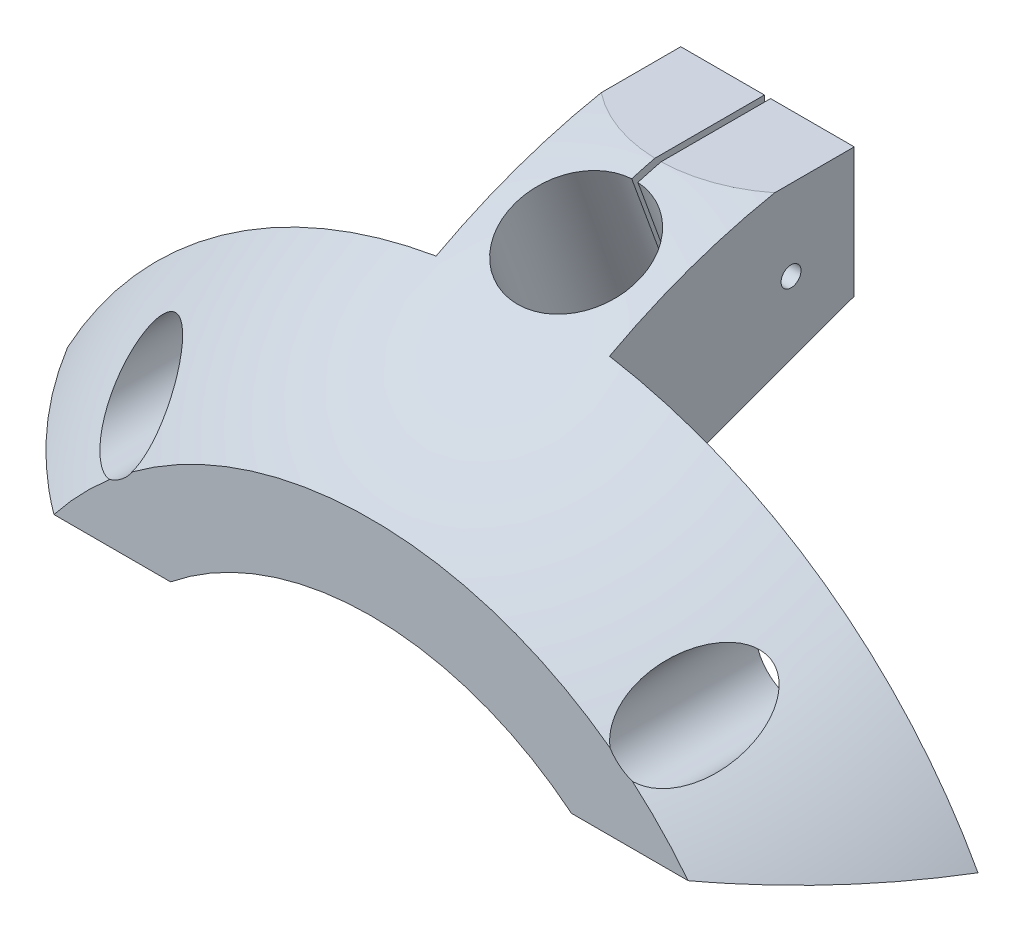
ISO-10303-21;
HEADER;
FILE_DESCRIPTION(('STEP AP214'),'2;1');
FILE_NAME('part.step','',(''),(''),'','','');
FILE_SCHEMA(('AUTOMOTIVE_DESIGN { 1 0 10303 214 1 1 1 1 }'));
ENDSEC;
DATA;
#1=APPLICATION_CONTEXT('core data for automotive mechanical design processes');
#2=APPLICATION_PROTOCOL_DEFINITION('international standard','automotive_design',2000,#1);
#3=PRODUCT_CONTEXT('',#1,'mechanical');
#4=PRODUCT('Part','Part','',(#3));
#5=PRODUCT_RELATED_PRODUCT_CATEGORY('part','',(#4));
#6=PRODUCT_DEFINITION_FORMATION('','',#4);
#7=PRODUCT_DEFINITION_CONTEXT('part definition',#1,'design');
#8=PRODUCT_DEFINITION('design','',#6,#7);
#9=PRODUCT_DEFINITION_SHAPE('','',#8);
#10=(LENGTH_UNIT() NAMED_UNIT(*) SI_UNIT(.MILLI.,.METRE.));
#11=(NAMED_UNIT(*) PLANE_ANGLE_UNIT() SI_UNIT($,.RADIAN.));
#12=(NAMED_UNIT(*) SI_UNIT($,.STERADIAN.) SOLID_ANGLE_UNIT());
#13=UNCERTAINTY_MEASURE_WITH_UNIT(LENGTH_MEASURE(1.E-05),#10,'distance_accuracy_value','');
#14=(GEOMETRIC_REPRESENTATION_CONTEXT(3) GLOBAL_UNCERTAINTY_ASSIGNED_CONTEXT((#13)) GLOBAL_UNIT_ASSIGNED_CONTEXT((#10,
#11,#12)) REPRESENTATION_CONTEXT('',''));
#15=CARTESIAN_POINT('',(0.,0.,0.));
#16=DIRECTION('',(0.,0.,1.));
#17=DIRECTION('',(1.,0.,0.));
#18=AXIS2_PLACEMENT_3D('',#15,#16,#17);
#19=CARTESIAN_POINT('',(26.19375,146.05,-152.4));
#20=DIRECTION('',(0.,1.,0.));
#21=DIRECTION('',(0.,0.,1.));
#22=AXIS2_PLACEMENT_3D('',#19,#20,#21);
#23=PLANE('',#22);
#24=CARTESIAN_POINT('',(0.,146.05,42.8997677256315));
#25=DIRECTION('',(0.,1.,0.));
#26=DIRECTION('',(0.,0.,1.));
#27=AXIS2_PLACEMENT_3D('',#24,#25,#26);
#28=CIRCLE('',#27,35.9757938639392);
#29=CARTESIAN_POINT('',(-0.793750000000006,146.05,78.866804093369));
#30=VERTEX_POINT('',#29);
#31=CARTESIAN_POINT('',(-22.225,146.05,71.1894676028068));
#32=VERTEX_POINT('',#31);
#33=EDGE_CURVE('E270',#30,#32,#28,.F.);
#34=ORIENTED_EDGE('',*,*,#33,.F.);
#35=DIRECTION('',(0.,0.,1.));
#36=VECTOR('',#35,1.);
#37=CARTESIAN_POINT('',(-0.79375,146.05,26.3876239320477));
#38=LINE('',#37,#36);
#39=CARTESIAN_POINT('',(-0.793750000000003,146.05,50.8000000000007));
#40=VERTEX_POINT('',#39);
#41=EDGE_CURVE('E374',#40,#30,#38,.T.);
#42=ORIENTED_EDGE('',*,*,#41,.F.);
#43=DIRECTION('',(1.,0.,0.));
#44=VECTOR('',#43,1.);
#45=CARTESIAN_POINT('',(-26.19375,146.05,50.8000000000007));
#46=LINE('',#45,#44);
#47=CARTESIAN_POINT('',(-22.225,146.05,50.8000000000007));
#48=VERTEX_POINT('',#47);
#49=EDGE_CURVE('E249',#48,#40,#46,.T.);
#50=ORIENTED_EDGE('',*,*,#49,.F.);
#51=DIRECTION('',(0.,0.,-1.));
#52=VECTOR('',#51,1.);
#53=CARTESIAN_POINT('',(-22.225,146.05,113.50625));
#54=LINE('',#53,#52);
#55=EDGE_CURVE('E220',#32,#48,#54,.T.);
#56=ORIENTED_EDGE('',*,*,#55,.F.);
#57=EDGE_LOOP('',(#34,#42,#50,#56));
#58=FACE_BOUND('',#57,.T.);
#59=ADVANCED_FACE('F43',(#58),#23,.T.);
#60=CARTESIAN_POINT('',(0.793750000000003,146.05,50.8000000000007));
#61=VERTEX_POINT('',#60);
#62=CARTESIAN_POINT('',(22.225,146.05,50.8000000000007));
#63=VERTEX_POINT('',#62);
#64=EDGE_CURVE('E248',#61,#63,#46,.T.);
#65=ORIENTED_EDGE('',*,*,#64,.F.);
#66=DIRECTION('',(0.,0.,-1.));
#67=VECTOR('',#66,1.);
#68=CARTESIAN_POINT('',(0.79375,146.05,26.3876239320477));
#69=LINE('',#68,#67);
#70=CARTESIAN_POINT('',(0.793750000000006,146.05,78.866804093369));
#71=VERTEX_POINT('',#70);
#72=EDGE_CURVE('E391',#71,#61,#69,.T.);
#73=ORIENTED_EDGE('',*,*,#72,.F.);
#74=CARTESIAN_POINT('',(22.225,146.05,71.1894676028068));
#75=VERTEX_POINT('',#74);
#76=EDGE_CURVE('E272',#75,#71,#28,.F.);
#77=ORIENTED_EDGE('',*,*,#76,.F.);
#78=DIRECTION('',(0.,0.,1.));
#79=VECTOR('',#78,1.);
#80=CARTESIAN_POINT('',(22.225,146.05,113.50625));
#81=LINE('',#80,#79);
#82=EDGE_CURVE('E233',#63,#75,#81,.T.);
#83=ORIENTED_EDGE('',*,*,#82,.F.);
#84=EDGE_LOOP('',(#65,#73,#77,#83));
#85=FACE_BOUND('',#84,.T.);
#86=ADVANCED_FACE('F343',(#85),#23,.T.);
#87=CARTESIAN_POINT('',(0.,0.,-152.4));
#88=DIRECTION('',(0.,0.,1.));
#89=DIRECTION('',(1.,0.,0.));
#90=AXIS2_PLACEMENT_3D('',#87,#88,#89);
#91=CYLINDRICAL_SURFACE('',#90,81.676875);
#92=DIRECTION('',(0.,0.,1.));
#93=VECTOR('',#92,1.);
#94=CARTESIAN_POINT('',(-51.3698540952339,63.5,-152.4));
#95=LINE('',#94,#93);
#96=CARTESIAN_POINT('',(-51.3698540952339,63.5,113.50625));
#97=VERTEX_POINT('',#96);
#98=CARTESIAN_POINT('',(-51.3698540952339,63.5,152.4));
#99=VERTEX_POINT('',#98);
#100=EDGE_CURVE('E257',#97,#99,#95,.T.);
#101=ORIENTED_EDGE('',*,*,#100,.F.);
#102=CARTESIAN_POINT('',(0.,0.,113.50625));
#103=DIRECTION('',(0.,0.,-1.));
#104=DIRECTION('',(-1.,0.,0.));
#105=AXIS2_PLACEMENT_3D('',#102,#103,#104);
#106=CIRCLE('',#105,81.676875);
#107=CARTESIAN_POINT('',(51.369854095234,63.5,113.50625));
#108=VERTEX_POINT('',#107);
#109=EDGE_CURVE('E245',#97,#108,#106,.T.);
#110=ORIENTED_EDGE('',*,*,#109,.T.);
#111=DIRECTION('',(0.,0.,1.));
#112=VECTOR('',#111,1.);
#113=CARTESIAN_POINT('',(51.369854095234,63.5,-152.4));
#114=LINE('',#113,#112);
#115=CARTESIAN_POINT('',(51.369854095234,63.5,152.4));
#116=VERTEX_POINT('',#115);
#117=EDGE_CURVE('E261',#116,#108,#114,.F.);
#118=ORIENTED_EDGE('',*,*,#117,.F.);
#119=CARTESIAN_POINT('',(0.,0.,152.4));
#120=DIRECTION('',(0.,0.,-1.));
#121=DIRECTION('',(1.,0.,0.));
#122=AXIS2_PLACEMENT_3D('',#119,#120,#121);
#123=CIRCLE('',#122,81.676875);
#124=EDGE_CURVE('E276',#99,#116,#123,.T.);
#125=ORIENTED_EDGE('',*,*,#124,.F.);
#126=EDGE_LOOP('',(#101,#110,#118,#125));
#127=FACE_BOUND('',#126,.T.);
#128=ADVANCED_FACE('F348',(#127),#91,.F.);
#129=CARTESIAN_POINT('',(0.,0.,42.8997677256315));
#130=DIRECTION('',(0.,0.,-1.));
#131=DIRECTION('',(0.,1.,0.));
#132=AXIS2_PLACEMENT_3D('',#129,#130,#131);
#133=SPHERICAL_SURFACE('',#132,150.415625);
#134=CARTESIAN_POINT('',(-0.793750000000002,0.,42.8997677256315));
#135=DIRECTION('',(1.,0.,0.));
#136=DIRECTION('',(0.,0.,-1.));
#137=AXIS2_PLACEMENT_3D('',#134,#135,#136);
#138=CIRCLE('',#137,150.413530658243);
#139=CARTESIAN_POINT('',(-0.793750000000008,144.457816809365,84.8064422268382));
#140=VERTEX_POINT('',#139);
#141=EDGE_CURVE('E72',#30,#140,#138,.T.);
#142=ORIENTED_EDGE('',*,*,#141,.F.);
#143=ORIENTED_EDGE('',*,*,#33,.T.);
#144=CARTESIAN_POINT('',(-22.225,0.,42.8997677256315));
#145=DIRECTION('',(-1.,0.,0.));
#146=DIRECTION('',(0.,0.,1.));
#147=AXIS2_PLACEMENT_3D('',#144,#145,#146);
#148=CIRCLE('',#147,148.76461144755);
#149=CARTESIAN_POINT('',(-22.225,130.941339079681,113.50625));
#150=VERTEX_POINT('',#149);
#151=EDGE_CURVE('E224',#150,#32,#148,.T.);
#152=ORIENTED_EDGE('',*,*,#151,.F.);
#153=CARTESIAN_POINT('',(0.,0.,113.50625));
#154=DIRECTION('',(0.,0.,-1.));
#155=DIRECTION('',(-1.,0.,0.));
#156=AXIS2_PLACEMENT_3D('',#153,#154,#155);
#157=CIRCLE('',#156,132.814099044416);
#158=CARTESIAN_POINT('',(-116.650481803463,63.5,113.50625));
#159=VERTEX_POINT('',#158);
#160=EDGE_CURVE('E218',#159,#150,#157,.T.);
#161=ORIENTED_EDGE('',*,*,#160,.F.);
#162=CARTESIAN_POINT('',(0.,63.5,42.8997677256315));
#163=DIRECTION('',(0.,1.,0.));
#164=DIRECTION('',(0.,0.,1.));
#165=AXIS2_PLACEMENT_3D('',#162,#163,#164);
#166=CIRCLE('',#165,136.354722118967);
#167=CARTESIAN_POINT('',(-81.2545960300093,63.5,152.4));
#168=VERTEX_POINT('',#167);
#169=EDGE_CURVE('E280',#159,#168,#166,.T.);
#170=ORIENTED_EDGE('',*,*,#169,.T.);
#171=CARTESIAN_POINT('',(0.,0.,152.4));
#172=DIRECTION('',(0.,0.,-1.));
#173=DIRECTION('',(-1.,0.,0.));
#174=AXIS2_PLACEMENT_3D('',#171,#172,#173);
#175=CIRCLE('',#174,103.124);
#176=CARTESIAN_POINT('',(-66.9837098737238,78.4075378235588,152.4));
#177=VERTEX_POINT('',#176);
#178=EDGE_CURVE('E266',#168,#177,#175,.T.);
#179=ORIENTED_EDGE('',*,*,#178,.T.);
#180=CARTESIAN_POINT('',(-66.9831572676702,78.4077306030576,152.4002));
#181=CARTESIAN_POINT('',(-67.5616816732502,78.2059306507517,152.19081770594));
#182=CARTESIAN_POINT('',(-68.1387715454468,78.058144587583,151.937880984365));
#183=CARTESIAN_POINT('',(-68.9879499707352,77.9078508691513,151.509117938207));
#184=CARTESIAN_POINT('',(-69.2667274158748,77.8696691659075,151.358961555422));
#185=CARTESIAN_POINT('',(-69.8183394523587,77.8147274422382,151.044253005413));
#186=CARTESIAN_POINT('',(-70.0911700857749,77.7979812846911,150.879691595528));
#187=CARTESIAN_POINT('',(-70.703972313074,77.7823483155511,150.491033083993));
#188=CARTESIAN_POINT('',(-71.0416459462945,77.789681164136,150.263056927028));
#189=CARTESIAN_POINT('',(-71.7032600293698,77.8331550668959,149.790686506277));
#190=CARTESIAN_POINT('',(-72.0271987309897,77.869299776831,149.546290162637));
#191=CARTESIAN_POINT('',(-72.6620158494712,77.967572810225,149.04267478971));
#192=CARTESIAN_POINT('',(-72.9728150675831,78.0298391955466,148.78338341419));
#193=CARTESIAN_POINT('',(-73.5789022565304,78.1776009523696,148.253626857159));
#194=CARTESIAN_POINT('',(-73.8741890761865,78.2630980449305,147.983160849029));
#195=CARTESIAN_POINT('',(-74.5704481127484,78.4954562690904,147.316771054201));
#196=CARTESIAN_POINT('',(-74.9633651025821,78.652982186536,146.916118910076));
#197=CARTESIAN_POINT('',(-75.7170138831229,79.0044149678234,146.1007167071));
#198=CARTESIAN_POINT('',(-76.0777326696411,79.1983364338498,145.685961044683));
#199=CARTESIAN_POINT('',(-76.7667715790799,79.6178210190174,144.846147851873));
#200=CARTESIAN_POINT('',(-77.095106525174,79.8433695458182,144.421095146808));
#201=CARTESIAN_POINT('',(-77.719621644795,80.3224385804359,143.563392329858));
#202=CARTESIAN_POINT('',(-78.0158055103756,80.5759558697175,143.13074309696));
#203=CARTESIAN_POINT('',(-78.5853466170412,81.116814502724,142.245766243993));
#204=CARTESIAN_POINT('',(-78.8576270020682,81.4049963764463,141.793260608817));
#205=CARTESIAN_POINT('',(-79.3677705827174,82.0054848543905,140.884864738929));
#206=CARTESIAN_POINT('',(-79.6056316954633,82.3177929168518,140.428974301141));
#207=CARTESIAN_POINT('',(-80.0465719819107,82.9646880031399,139.515652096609));
#208=CARTESIAN_POINT('',(-80.2496273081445,83.299290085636,139.058219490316));
#209=CARTESIAN_POINT('',(-80.619844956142,83.9889551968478,138.144285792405));
#210=CARTESIAN_POINT('',(-80.7870090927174,84.3440171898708,137.687784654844));
#211=CARTESIAN_POINT('',(-81.0852316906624,85.0763001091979,136.774345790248));
#212=CARTESIAN_POINT('',(-81.2159902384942,85.4536757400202,136.317433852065));
#213=CARTESIAN_POINT('',(-81.4375018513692,86.2270917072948,135.409497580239));
#214=CARTESIAN_POINT('',(-81.5282467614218,86.623135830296,134.958474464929));
#215=CARTESIAN_POINT('',(-81.666550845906,87.4324100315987,134.066512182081));
#216=CARTESIAN_POINT('',(-81.7141766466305,87.8456125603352,133.625558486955));
#217=CARTESIAN_POINT('',(-81.7622678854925,88.6889366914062,132.757602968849));
#218=CARTESIAN_POINT('',(-81.7627617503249,89.1190479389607,132.330592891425));
#219=CARTESIAN_POINT('',(-81.7218224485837,89.8099568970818,131.673062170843));
#220=CARTESIAN_POINT('',(-81.6980272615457,90.0654560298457,131.435796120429));
#221=CARTESIAN_POINT('',(-81.6313774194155,90.5814832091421,130.969599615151));
#222=CARTESIAN_POINT('',(-81.5885279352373,90.8420098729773,130.740666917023));
#223=CARTESIAN_POINT('',(-81.4821470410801,91.3675153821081,130.293239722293));
#224=CARTESIAN_POINT('',(-81.4186291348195,91.6324912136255,130.07473851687));
#225=CARTESIAN_POINT('',(-81.2689822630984,92.166330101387,129.650572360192));
#226=CARTESIAN_POINT('',(-81.1828589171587,92.4351921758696,129.444904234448));
#227=CARTESIAN_POINT('',(-81.0097919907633,92.9100168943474,129.097635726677));
#228=CARTESIAN_POINT('',(-80.92812721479,93.1153976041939,128.952606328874));
#229=CARTESIAN_POINT('',(-80.7496163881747,93.5270336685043,128.673443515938));
#230=CARTESIAN_POINT('',(-80.6527704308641,93.7332890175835,128.539310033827));
#231=CARTESIAN_POINT('',(-80.4430764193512,94.1454023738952,128.284102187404));
#232=CARTESIAN_POINT('',(-80.330247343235,94.351260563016,128.163012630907));
#233=CARTESIAN_POINT('',(-80.0877155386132,94.7613878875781,127.936036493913));
#234=CARTESIAN_POINT('',(-79.958019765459,94.9656576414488,127.83014368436));
#235=CARTESIAN_POINT('',(-79.7132978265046,95.3239017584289,127.658515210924));
#236=CARTESIAN_POINT('',(-79.6018248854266,95.4785736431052,127.589157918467));
#237=CARTESIAN_POINT('',(-79.3686346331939,95.7848422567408,127.462082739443));
#238=CARTESIAN_POINT('',(-79.2469231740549,95.9364406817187,127.404358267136));
#239=CARTESIAN_POINT('',(-78.9934724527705,96.2354052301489,127.301659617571));
#240=CARTESIAN_POINT('',(-78.8617384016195,96.3827734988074,127.256678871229));
#241=CARTESIAN_POINT('',(-78.5886710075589,96.6720940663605,127.180419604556));
#242=CARTESIAN_POINT('',(-78.4473376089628,96.814046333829,127.14914116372));
#243=CARTESIAN_POINT('',(-78.1550475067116,97.0920059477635,127.100911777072));
#244=CARTESIAN_POINT('',(-78.004041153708,97.2279753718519,127.084042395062));
#245=CARTESIAN_POINT('',(-77.6942355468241,97.4918396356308,127.06537055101));
#246=CARTESIAN_POINT('',(-77.5354363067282,97.6197344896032,127.063568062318));
#247=CARTESIAN_POINT('',(-77.2113743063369,97.8663499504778,127.075078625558));
#248=CARTESIAN_POINT('',(-77.0461109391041,97.9850696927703,127.088393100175));
#249=CARTESIAN_POINT('',(-76.7106138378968,98.21245890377,127.129788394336));
#250=CARTESIAN_POINT('',(-76.5403802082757,98.3211285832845,127.157868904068));
#251=CARTESIAN_POINT('',(-76.2099940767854,98.5197061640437,127.225325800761));
#252=CARTESIAN_POINT('',(-76.0501047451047,98.6104177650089,127.263637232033));
#253=CARTESIAN_POINT('',(-75.7284472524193,98.7826537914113,127.351440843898));
#254=CARTESIAN_POINT('',(-75.5666785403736,98.8641754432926,127.400936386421));
#255=CARTESIAN_POINT('',(-75.0800572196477,99.0948741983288,127.564941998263));
#256=CARTESIAN_POINT('',(-74.7537331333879,99.2302780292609,127.695004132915));
#257=CARTESIAN_POINT('',(-74.1844206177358,99.4365669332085,127.952582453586));
#258=CARTESIAN_POINT('',(-73.9407446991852,99.515127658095,128.072802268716));
#259=CARTESIAN_POINT('',(-73.4566013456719,99.6535505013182,128.329491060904));
#260=CARTESIAN_POINT('',(-73.2161345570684,99.7134089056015,128.465963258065));
#261=CARTESIAN_POINT('',(-72.7391901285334,99.8158809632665,128.75278540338));
#262=CARTESIAN_POINT('',(-72.5027225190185,99.8584560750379,128.9031654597));
#263=CARTESIAN_POINT('',(-72.0350681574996,99.9275903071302,129.21527120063));
#264=CARTESIAN_POINT('',(-71.8038813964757,99.9541494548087,129.376996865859));
#265=CARTESIAN_POINT('',(-71.2226142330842,100.003065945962,129.800733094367));
#266=CARTESIAN_POINT('',(-70.8764573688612,100.015231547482,130.069332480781));
#267=CARTESIAN_POINT('',(-70.1984302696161,100.008751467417,130.623665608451));
#268=CARTESIAN_POINT('',(-69.8665678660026,99.9900891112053,130.90940854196));
#269=CARTESIAN_POINT('',(-69.2168883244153,99.9253538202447,131.494342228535));
#270=CARTESIAN_POINT('',(-68.8990930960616,99.8792396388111,131.793552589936));
#271=CARTESIAN_POINT('',(-68.2780461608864,99.7623619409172,132.401903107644));
#272=CARTESIAN_POINT('',(-67.9747936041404,99.6915998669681,132.711042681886));
#273=CARTESIAN_POINT('',(-67.2318879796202,99.4859309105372,133.496239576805));
#274=CARTESIAN_POINT('',(-66.8013329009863,99.3367055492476,133.97720111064));
#275=CARTESIAN_POINT('',(-65.9723399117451,98.9929162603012,134.950578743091));
#276=CARTESIAN_POINT('',(-65.5739177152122,98.7983303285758,135.443000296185));
#277=CARTESIAN_POINT('',(-64.8090150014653,98.3676459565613,136.435307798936));
#278=CARTESIAN_POINT('',(-64.4425684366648,98.1315041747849,136.935201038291));
#279=CARTESIAN_POINT('',(-63.7428221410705,97.6208035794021,137.93834274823));
#280=CARTESIAN_POINT('',(-63.4095169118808,97.3462511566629,138.441590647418));
#281=CARTESIAN_POINT('',(-62.7686538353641,96.7527958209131,139.462266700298));
#282=CARTESIAN_POINT('',(-62.4620460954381,96.4328875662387,139.97970727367));
#283=CARTESIAN_POINT('',(-61.887266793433,95.756290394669,141.01206479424));
#284=CARTESIAN_POINT('',(-61.6191013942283,95.3995955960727,141.526981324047));
#285=CARTESIAN_POINT('',(-61.1247252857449,94.6512331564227,142.550330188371));
#286=CARTESIAN_POINT('',(-60.8984578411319,94.2596138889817,143.058770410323));
#287=CARTESIAN_POINT('',(-60.4916511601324,93.442126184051,144.066220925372));
#288=CARTESIAN_POINT('',(-60.3110944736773,93.0162708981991,144.565234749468));
#289=CARTESIAN_POINT('',(-60.046713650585,92.261539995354,145.404846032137));
#290=CARTESIAN_POINT('',(-59.9500561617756,91.9409521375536,145.74889345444));
#291=CARTESIAN_POINT('',(-59.7846360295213,91.2837230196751,146.428360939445));
#292=CARTESIAN_POINT('',(-59.7158729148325,90.9470820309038,146.763781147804));
#293=CARTESIAN_POINT('',(-59.6091130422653,90.2585899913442,147.42359735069));
#294=CARTESIAN_POINT('',(-59.5711066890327,89.9067437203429,147.747996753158));
#295=CARTESIAN_POINT('',(-59.5291896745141,89.1888718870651,148.382993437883));
#296=CARTESIAN_POINT('',(-59.5252680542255,88.8228509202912,148.693595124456));
#297=CARTESIAN_POINT('',(-59.5512573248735,88.1809949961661,149.214115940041));
#298=CARTESIAN_POINT('',(-59.5721300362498,87.9081476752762,149.428164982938));
#299=CARTESIAN_POINT('',(-59.6354155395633,87.3568498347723,149.845450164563));
#300=CARTESIAN_POINT('',(-59.6778280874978,87.078399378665,150.048686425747));
#301=CARTESIAN_POINT('',(-59.8397245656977,86.2382997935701,150.637876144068));
#302=CARTESIAN_POINT('',(-59.9939376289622,85.6693093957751,151.005432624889));
#303=CARTESIAN_POINT('',(-60.3317530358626,84.7412232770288,151.546231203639));
#304=CARTESIAN_POINT('',(-60.4830999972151,84.3827591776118,151.740904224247));
#305=CARTESIAN_POINT('',(-60.8313777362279,83.6689582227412,152.097294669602));
#306=CARTESIAN_POINT('',(-61.0285472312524,83.3136482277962,152.25883086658));
#307=CARTESIAN_POINT('',(-61.2496155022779,82.9638486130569,152.4002));
#308=B_SPLINE_CURVE_WITH_KNOTS('',3,(#180,#181,#182,#183,#184,#185,#186,#187,#188,#189,#190,
#191,#192,#193,#194,#195,#196,#197,#198,#199,#200,#201,#202,#203,#204,#205,#206,#207,#208,#209,
#210,#211,#212,#213,#214,#215,#216,#217,#218,#219,#220,#221,#222,#223,#224,#225,#226,#227,#228,
#229,#230,#231,#232,#233,#234,#235,#236,#237,#238,#239,#240,#241,#242,#243,#244,#245,#246,#247,
#248,#249,#250,#251,#252,#253,#254,#255,#256,#257,#258,#259,#260,#261,#262,#263,#264,#265,#266,
#267,#268,#269,#270,#271,#272,#273,#274,#275,#276,#277,#278,#279,#280,#281,#282,#283,#284,#285,
#286,#287,#288,#289,#290,#291,#292,#293,#294,#295,#296,#297,#298,#299,#300,#301,#302,#303,#304,
#305,#306,#307),.UNSPECIFIED.,.F.,.F.,(4,2,2,2,2,2,2,2,2,2,2,2,2,2,2,2,2,2,2,2,2,2,2,2,2,2,2,2,
2,2,2,2,2,2,2,2,2,2,2,2,2,2,2,2,2,2,2,2,2,2,2,2,2,2,2,2,2,2,2,2,2,2,2,4),(0.,1.93278309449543,
2.88836836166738,3.84457131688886,5.0652091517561,6.28600189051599,7.51332988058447,
8.74074882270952,10.48672465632,12.2334024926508,13.9792770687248,15.7249509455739,
17.5282746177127,19.3317073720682,21.1363708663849,22.9409430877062,24.759969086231,
26.5793656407,28.3959460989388,30.2114309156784,31.2593500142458,32.3069849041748,
33.3539366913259,34.4006284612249,35.1931215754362,35.9856098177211,36.7771648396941,
37.568394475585,38.1764797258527,38.7842197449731,39.3916459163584,39.9990756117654,
40.6099213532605,41.2207660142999,41.8316681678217,42.4425575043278,43.0052902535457,
43.5681923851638,44.6934478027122,45.54094282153,46.3886060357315,47.2381492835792,
48.0876910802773,49.4005669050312,50.7141530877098,52.029717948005,53.3452058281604,
55.3299629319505,57.3156848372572,59.3034901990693,61.2909652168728,63.3326437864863,
65.3746493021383,67.4138691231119,69.4523092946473,70.8915735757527,72.3308135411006,
73.769604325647,75.2079324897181,76.2493211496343,77.2906980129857,79.3634887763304,
80.6654610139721,81.9743743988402),.UNSPECIFIED.);
#309=CARTESIAN_POINT('',(-61.2493028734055,82.9643433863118,152.4));
#310=VERTEX_POINT('',#309);
#311=EDGE_CURVE('E303',#177,#310,#308,.T.);
#312=ORIENTED_EDGE('',*,*,#311,.T.);
#313=CARTESIAN_POINT('',(61.2493028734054,82.9643433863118,152.4));
#314=VERTEX_POINT('',#313);
#315=EDGE_CURVE('E271',#310,#314,#175,.T.);
#316=ORIENTED_EDGE('',*,*,#315,.T.);
#317=CARTESIAN_POINT('',(61.2496155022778,82.9638486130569,152.4002));
#318=CARTESIAN_POINT('',(60.9223444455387,83.4818325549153,152.19081770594));
#319=CARTESIAN_POINT('',(60.6480151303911,84.0106206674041,151.937880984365));
#320=CARTESIAN_POINT('',(60.3097787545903,84.8038976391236,151.509117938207));
#321=CARTESIAN_POINT('',(60.2096087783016,85.0668437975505,151.358961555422));
#322=CARTESIAN_POINT('',(60.0314792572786,85.5917859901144,151.044253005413));
#323=CARTESIAN_POINT('',(59.9535341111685,85.8537813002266,150.879691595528));
#324=CARTESIAN_POINT('',(59.7998745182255,86.4472117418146,150.491033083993));
#325=CARTESIAN_POINT('',(59.7307380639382,86.7778133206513,150.263056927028));
#326=CARTESIAN_POINT('',(59.6236309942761,87.4321459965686,149.790686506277));
#327=CARTESIAN_POINT('',(59.5856643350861,87.755876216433,149.546290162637));
#328=CARTESIAN_POINT('',(59.5379932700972,88.3964836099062,149.04267478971));
#329=CARTESIAN_POINT('',(59.5284412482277,88.7133148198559,148.78338341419));
#330=CARTESIAN_POINT('',(59.53546970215,89.3371143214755,148.253626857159));
#331=CARTESIAN_POINT('',(59.5520521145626,89.6440818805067,147.983160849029));
#332=CARTESIAN_POINT('',(59.6211206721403,90.3748325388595,147.316771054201));
#333=CARTESIAN_POINT('',(59.685815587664,90.7931777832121,146.916118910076));
#334=CARTESIAN_POINT('',(59.8579165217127,91.6067334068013,146.100716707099));
#335=CARTESIAN_POINT('',(59.9653397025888,92.0019344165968,145.685961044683));
#336=CARTESIAN_POINT('',(60.2183286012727,92.7679230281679,144.846147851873));
#337=CARTESIAN_POINT('',(60.3638767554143,93.1387217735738,144.421095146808));
#338=CARTESIAN_POINT('',(60.6894856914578,93.8553144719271,143.563392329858));
#339=CARTESIAN_POINT('',(60.8695425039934,94.2011112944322,143.13074309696));
#340=CARTESIAN_POINT('',(61.2677623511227,94.8781091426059,142.245766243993));
#341=CARTESIAN_POINT('',(61.4869874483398,95.20845102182,141.793260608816));
#342=CARTESIAN_POINT('',(61.9567135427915,95.8410569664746,140.884864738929));
#343=CARTESIAN_POINT('',(62.2072164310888,96.1433193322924,140.428974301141));
#344=CARTESIAN_POINT('',(62.7377824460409,96.7189939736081,139.515652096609));
#345=CARTESIAN_POINT('',(63.0178656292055,96.9923864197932,139.058219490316));
#346=CARTESIAN_POINT('',(63.6060721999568,97.5088281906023,138.144285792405));
#347=CARTESIAN_POINT('',(63.9141941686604,97.7518790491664,137.687784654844));
#348=CARTESIAN_POINT('',(64.560180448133,98.2078140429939,136.774345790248));
#349=CARTESIAN_POINT('',(64.8982632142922,98.4204409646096,136.317433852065));
#350=CARTESIAN_POINT('',(65.6016481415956,98.8109397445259,135.409497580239));
#351=CARTESIAN_POINT('',(65.9669558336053,98.9888045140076,134.958474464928));
#352=CARTESIAN_POINT('',(66.724068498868,99.306346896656,134.066512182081));
#353=CARTESIAN_POINT('',(67.1158315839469,99.4460831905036,133.625558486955));
#354=CARTESIAN_POINT('',(67.926492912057,99.6834364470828,132.757602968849));
#355=CARTESIAN_POINT('',(68.3453746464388,99.7810787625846,132.330592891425));
#356=CARTESIAN_POINT('',(69.0276723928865,99.8972725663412,131.673062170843));
#357=CARTESIAN_POINT('',(69.2819424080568,99.9318091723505,131.435796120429));
#358=CARTESIAN_POINT('',(69.7996868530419,99.9834516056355,130.969599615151));
#359=CARTESIAN_POINT('',(70.0631587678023,100.000562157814,130.740666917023));
#360=CARTESIAN_POINT('',(70.5991116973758,100.015641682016,130.293239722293));
#361=CARTESIAN_POINT('',(70.8715867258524,100.013623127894,130.07473851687));
#362=CARTESIAN_POINT('',(71.4254313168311,99.9884375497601,129.650572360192));
#363=CARTESIAN_POINT('',(71.7067986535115,99.9652757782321,129.444904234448));
#364=CARTESIAN_POINT('',(72.2084450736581,99.9039443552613,129.097635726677));
#365=CARTESIAN_POINT('',(72.4269647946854,99.8707855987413,128.952606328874));
#366=CARTESIAN_POINT('',(72.8682856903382,99.7898768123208,128.673443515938));
#367=CARTESIAN_POINT('',(73.0910868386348,99.7421268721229,128.539310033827));
#368=CARTESIAN_POINT('',(73.5399169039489,99.6309487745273,128.284102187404));
#369=CARTESIAN_POINT('',(73.7659417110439,99.5675391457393,128.163012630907));
#370=CARTESIAN_POINT('',(74.2202550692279,99.4239234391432,127.936036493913));
#371=CARTESIAN_POINT('',(74.4485426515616,99.3437242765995,127.83014368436));
#372=CARTESIAN_POINT('',(74.852808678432,99.1862547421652,127.658515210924));
#373=CARTESIAN_POINT('',(75.0286639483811,99.1126033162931,127.589157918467));
#374=CARTESIAN_POINT('',(75.37969300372,98.954626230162,127.462082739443));
#375=CARTESIAN_POINT('',(75.5548671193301,98.8703066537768,127.404358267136));
#376=CARTESIAN_POINT('',(75.9033577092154,98.6909428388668,127.301659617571));
#377=CARTESIAN_POINT('',(76.0766750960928,98.5959041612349,127.256678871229));
#378=CARTESIAN_POINT('',(76.4202023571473,98.3952521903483,127.180419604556));
#379=CARTESIAN_POINT('',(76.5904122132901,98.2896388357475,127.14914116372));
#380=CARTESIAN_POINT('',(76.9272145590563,98.0676946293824,127.100911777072));
#381=CARTESIAN_POINT('',(77.0937813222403,97.9513068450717,127.084042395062));
#382=CARTESIAN_POINT('',(77.4208093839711,97.7091157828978,127.06537055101));
#383=CARTESIAN_POINT('',(77.5812706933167,97.5833125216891,127.063568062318));
#384=CARTESIAN_POINT('',(77.8947163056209,97.3233371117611,127.075078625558));
#385=CARTESIAN_POINT('',(78.0476999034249,97.1891641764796,127.088393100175));
#386=CARTESIAN_POINT('',(78.3449994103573,96.9137060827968,127.129788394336));
#387=CARTESIAN_POINT('',(78.4893155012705,96.7724210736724,127.157868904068));
#388=CARTESIAN_POINT('',(78.7573935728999,96.4954333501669,127.225325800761));
#389=CARTESIAN_POINT('',(78.8818790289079,96.3601685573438,127.263637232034));
#390=CARTESIAN_POINT('',(79.1223246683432,96.0857333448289,127.351440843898));
#391=CARTESIAN_POINT('',(79.2382822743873,95.9465617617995,127.400936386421));
#392=CARTESIAN_POINT('',(79.5729444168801,95.5246334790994,127.564941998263));
#393=CARTESIAN_POINT('',(79.778564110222,95.2373319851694,127.695004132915));
#394=CARTESIAN_POINT('',(80.1081271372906,94.7293358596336,127.952582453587));
#395=CARTESIAN_POINT('',(80.2397030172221,94.5097054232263,128.072802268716));
#396=CARTESIAN_POINT('',(80.4839147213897,94.0693461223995,128.329491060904));
#397=CARTESIAN_POINT('',(80.5965467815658,93.8486170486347,128.465963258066));
#398=CARTESIAN_POINT('',(80.8041107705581,93.4071493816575,128.75278540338));
#399=CARTESIAN_POINT('',(80.8990028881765,93.1864118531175,128.903165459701));
#400=CARTESIAN_POINT('',(81.0719921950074,92.7464631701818,129.215271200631));
#401=CARTESIAN_POINT('',(81.1500894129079,92.5272520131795,129.376996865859));
#402=CARTESIAN_POINT('',(81.3290484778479,91.9720601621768,129.800733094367));
#403=CARTESIAN_POINT('',(81.4190957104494,91.6375992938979,130.069332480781));
#404=CARTESIAN_POINT('',(81.5659480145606,90.9756346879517,130.623665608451));
#405=CARTESIAN_POINT('',(81.6227350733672,90.6481348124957,130.90940854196));
#406=CARTESIAN_POINT('',(81.7064343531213,90.0006252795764,131.494342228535));
#407=CARTESIAN_POINT('',(81.7333014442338,89.6806276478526,131.793552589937));
#408=CARTESIAN_POINT('',(81.7597381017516,89.049231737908,132.401903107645));
#409=CARTESIAN_POINT('',(81.7593092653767,88.7378329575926,132.711042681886));
#410=CARTESIAN_POINT('',(81.7267774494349,87.9676705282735,133.496239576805));
#411=CARTESIAN_POINT('',(81.678670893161,87.5145351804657,133.97720111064));
#412=CARTESIAN_POINT('',(81.5310359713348,86.6293095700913,134.950578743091));
#413=CARTESIAN_POINT('',(81.4314826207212,86.1972296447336,135.443000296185));
#414=CARTESIAN_POINT('',(81.1847209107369,85.3548082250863,136.435307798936));
#415=CARTESIAN_POINT('',(81.0374626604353,84.9444900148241,136.935201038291));
#416=CARTESIAN_POINT('',(80.6980343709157,84.1474652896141,137.93834274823));
#417=CARTESIAN_POINT('',(80.5058717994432,83.7607548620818,138.441590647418));
#418=CARTESIAN_POINT('',(80.0725263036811,83.0023971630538,139.462266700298));
#419=CARTESIAN_POINT('',(79.8301493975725,82.631448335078,139.97970727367));
#420=CARTESIAN_POINT('',(79.3008830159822,81.9186846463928,141.012064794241));
#421=CARTESIAN_POINT('',(79.0139864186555,81.57687446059,141.526981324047));
#422=CARTESIAN_POINT('',(78.3966469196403,80.9262240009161,142.550330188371));
#423=CARTESIAN_POINT('',(78.0662639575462,80.6173393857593,143.058770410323));
#424=CARTESIAN_POINT('',(77.361804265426,80.0363795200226,144.066220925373));
#425=CARTESIAN_POINT('',(76.9877442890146,79.7642902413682,144.565234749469));
#426=CARTESIAN_POINT('',(76.31224549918,79.336251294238,145.404846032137));
#427=CARTESIAN_POINT('',(76.0217792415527,79.1696721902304,145.748893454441));
#428=CARTESIAN_POINT('',(75.4189069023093,78.8600613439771,146.428360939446));
#429=CARTESIAN_POINT('',(75.1065011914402,78.7170292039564,146.763781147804));
#430=CARTESIAN_POINT('',(74.4599228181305,78.4575000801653,147.423597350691));
#431=CARTESIAN_POINT('',(74.1257569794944,78.340994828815,147.747996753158));
#432=CARTESIAN_POINT('',(73.4359103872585,78.1379956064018,148.382993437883));
#433=CARTESIAN_POINT('',(73.0802365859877,78.05149199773,148.693595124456));
#434=CARTESIAN_POINT('',(72.4491010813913,77.9318155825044,149.214115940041));
#435=CARTESIAN_POINT('',(72.1785914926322,77.8905131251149,149.428164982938));
#436=CARTESIAN_POINT('',(71.6272480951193,77.8276257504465,149.845450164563));
#437=CARTESIAN_POINT('',(71.34641440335,77.806040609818,150.048686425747));
#438=CARTESIAN_POINT('',(70.4914584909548,77.7739755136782,150.637876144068));
#439=CARTESIAN_POINT('',(69.9023395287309,77.7956686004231,151.005432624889));
#440=CARTESIAN_POINT('',(68.9219317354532,77.9150991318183,151.54623120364));
#441=CARTESIAN_POINT('',(68.5385446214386,77.9815576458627,151.740904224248));
#442=CARTESIAN_POINT('',(67.7645195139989,78.1595866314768,152.097294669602));
#443=CARTESIAN_POINT('',(67.3738537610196,78.2713957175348,152.25883086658));
#444=CARTESIAN_POINT('',(66.9831572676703,78.4077306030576,152.4002));
#445=B_SPLINE_CURVE_WITH_KNOTS('',3,(#317,#318,#319,#320,#321,#322,#323,#324,#325,#326,#327,
#328,#329,#330,#331,#332,#333,#334,#335,#336,#337,#338,#339,#340,#341,#342,#343,#344,#345,#346,
#347,#348,#349,#350,#351,#352,#353,#354,#355,#356,#357,#358,#359,#360,#361,#362,#363,#364,#365,
#366,#367,#368,#369,#370,#371,#372,#373,#374,#375,#376,#377,#378,#379,#380,#381,#382,#383,#384,
#385,#386,#387,#388,#389,#390,#391,#392,#393,#394,#395,#396,#397,#398,#399,#400,#401,#402,#403,
#404,#405,#406,#407,#408,#409,#410,#411,#412,#413,#414,#415,#416,#417,#418,#419,#420,#421,#422,
#423,#424,#425,#426,#427,#428,#429,#430,#431,#432,#433,#434,#435,#436,#437,#438,#439,#440,#441,
#442,#443,#444),.UNSPECIFIED.,.F.,.F.,(4,2,2,2,2,2,2,2,2,2,2,2,2,2,2,2,2,2,2,2,2,2,2,2,2,2,2,2,
2,2,2,2,2,2,2,2,2,2,2,2,2,2,2,2,2,2,2,2,2,2,2,2,2,2,2,2,2,2,2,2,2,2,2,4),(0.,1.93278309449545,
2.88836836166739,3.84457131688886,5.06520915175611,6.28600189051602,7.51332988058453,
8.74074882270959,10.4867246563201,12.2334024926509,13.9792770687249,15.724950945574,
17.5282746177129,19.3317073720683,21.1363708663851,22.9409430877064,24.7599690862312,
26.5793656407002,28.3959460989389,30.2114309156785,31.2593500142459,32.3069849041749,
33.3539366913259,34.400628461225,35.1931215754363,35.9856098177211,36.7771648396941,
37.5683944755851,38.1764797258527,38.7842197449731,39.3916459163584,39.9990756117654,
40.6099213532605,41.2207660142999,41.8316681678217,42.4425575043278,43.0052902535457,
43.5681923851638,44.6934478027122,45.5409428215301,46.3886060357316,47.2381492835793,
48.0876910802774,49.4005669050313,50.7141530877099,52.0297179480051,53.3452058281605,
55.3299629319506,57.3156848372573,59.3034901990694,61.290965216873,63.3326437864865,
65.3746493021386,67.4138691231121,69.4523092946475,70.8915735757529,72.3308135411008,
73.7696043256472,75.2079324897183,76.2493211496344,77.2906980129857,79.3634887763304,
80.665461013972,81.97437439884),.UNSPECIFIED.);
#446=CARTESIAN_POINT('',(66.9837098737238,78.4075378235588,152.4));
#447=VERTEX_POINT('',#446);
#448=EDGE_CURVE('E409',#314,#447,#445,.T.);
#449=ORIENTED_EDGE('',*,*,#448,.T.);
#450=CARTESIAN_POINT('',(81.2545960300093,63.5,152.4));
#451=VERTEX_POINT('',#450);
#452=EDGE_CURVE('E265',#447,#451,#175,.T.);
#453=ORIENTED_EDGE('',*,*,#452,.T.);
#454=CARTESIAN_POINT('',(116.650481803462,63.5,113.50625));
#455=VERTEX_POINT('',#454);
#456=EDGE_CURVE('E283',#451,#455,#166,.T.);
#457=ORIENTED_EDGE('',*,*,#456,.T.);
#458=CARTESIAN_POINT('',(0.,0.,113.50625));
#459=DIRECTION('',(0.,0.,-1.));
#460=DIRECTION('',(-1.,0.,0.));
#461=AXIS2_PLACEMENT_3D('',#458,#459,#460);
#462=CIRCLE('',#461,132.814099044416);
#463=CARTESIAN_POINT('',(22.225,130.941339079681,113.50625));
#464=VERTEX_POINT('',#463);
#465=EDGE_CURVE('E288',#464,#455,#462,.T.);
#466=ORIENTED_EDGE('',*,*,#465,.F.);
#467=CARTESIAN_POINT('',(22.225,0.,42.8997677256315));
#468=DIRECTION('',(1.,0.,0.));
#469=DIRECTION('',(0.,0.,-1.));
#470=AXIS2_PLACEMENT_3D('',#467,#468,#469);
#471=CIRCLE('',#470,148.76461144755);
#472=EDGE_CURVE('E239',#75,#464,#471,.T.);
#473=ORIENTED_EDGE('',*,*,#472,.F.);
#474=ORIENTED_EDGE('',*,*,#76,.T.);
#475=CARTESIAN_POINT('',(0.793750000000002,0.,42.8997677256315));
#476=DIRECTION('',(-1.,0.,0.));
#477=DIRECTION('',(0.,0.,1.));
#478=AXIS2_PLACEMENT_3D('',#475,#476,#477);
#479=CIRCLE('',#478,150.413530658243);
#480=CARTESIAN_POINT('',(0.793750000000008,144.457816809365,84.8064422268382));
#481=VERTEX_POINT('',#480);
#482=EDGE_CURVE('E395',#481,#71,#479,.T.);
#483=ORIENTED_EDGE('',*,*,#482,.F.);
#484=CARTESIAN_POINT('',(-5.80365078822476,144.057460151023,85.7789708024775));
#485=CARTESIAN_POINT('',(-5.3769312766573,144.11953152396,85.6281923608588));
#486=CARTESIAN_POINT('',(-4.94338742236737,144.174745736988,85.4940695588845));
#487=CARTESIAN_POINT('',(-4.06548781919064,144.271103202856,85.2600029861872));
#488=CARTESIAN_POINT('',(-3.62112927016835,144.312242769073,85.1600681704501));
#489=CARTESIAN_POINT('',(-2.7244171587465,144.380167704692,84.995066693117));
#490=CARTESIAN_POINT('',(-2.27205554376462,144.406937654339,84.9300374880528));
#491=CARTESIAN_POINT('',(-1.36301412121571,144.445866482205,84.8354719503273));
#492=CARTESIAN_POINT('',(-0.906334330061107,144.458025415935,84.8059354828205));
#493=CARTESIAN_POINT('',(0.00787356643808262,144.467642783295,84.7825729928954));
#494=CARTESIAN_POINT('',(0.465401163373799,144.46510822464,84.7887299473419));
#495=CARTESIAN_POINT('',(1.3782756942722,144.445372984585,84.8366707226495));
#496=CARTESIAN_POINT('',(1.8336225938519,144.428172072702,84.8784551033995));
#497=CARTESIAN_POINT('',(2.73877497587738,144.37923279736,84.9973376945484));
#498=CARTESIAN_POINT('',(3.18858183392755,144.347498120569,85.0744269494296));
#499=CARTESIAN_POINT('',(4.07957353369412,144.269719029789,85.2633652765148));
#500=CARTESIAN_POINT('',(4.52075840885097,144.22367467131,85.3752142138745));
#501=CARTESIAN_POINT('',(5.39140619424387,144.117600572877,85.6328827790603));
#502=CARTESIAN_POINT('',(5.82086823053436,144.05756979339,85.7787049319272));
#503=CARTESIAN_POINT('',(6.66498684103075,143.923952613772,86.1032744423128));
#504=CARTESIAN_POINT('',(7.079643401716,143.850366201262,86.2820218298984));
#505=CARTESIAN_POINT('',(7.89122394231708,143.69015890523,86.6711740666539));
#506=CARTESIAN_POINT('',(8.28814722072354,143.60353750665,86.8815801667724));
#507=CARTESIAN_POINT('',(9.06142861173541,143.417879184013,87.3325443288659));
#508=CARTESIAN_POINT('',(9.43778671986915,143.318842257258,87.5731023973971));
#509=CARTESIAN_POINT('',(10.1674345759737,143.109010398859,88.0827711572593));
#510=CARTESIAN_POINT('',(10.5207138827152,142.998210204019,88.3518946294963));
#511=CARTESIAN_POINT('',(11.2015154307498,142.765676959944,88.9166876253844));
#512=CARTESIAN_POINT('',(11.5290376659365,142.643943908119,89.2123571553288));
#513=CARTESIAN_POINT('',(12.1560061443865,142.39041046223,89.8281376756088));
#514=CARTESIAN_POINT('',(12.4554523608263,142.258610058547,90.148248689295));
#515=CARTESIAN_POINT('',(13.0241499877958,141.985878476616,90.8106351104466));
#516=CARTESIAN_POINT('',(13.2934013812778,141.844947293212,91.1529105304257));
#517=CARTESIAN_POINT('',(13.8000092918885,141.554838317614,91.8574761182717));
#518=CARTESIAN_POINT('',(14.0373400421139,141.405653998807,92.219782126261));
#519=CARTESIAN_POINT('',(14.4781727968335,141.100202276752,92.9615810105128));
#520=CARTESIAN_POINT('',(14.6816747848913,140.943934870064,93.3410738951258));
#521=CARTESIAN_POINT('',(15.0534117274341,140.625426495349,94.1145501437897));
#522=CARTESIAN_POINT('',(15.221646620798,140.46318551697,94.5085335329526));
#523=CARTESIAN_POINT('',(15.5216604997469,140.133881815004,95.3081920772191));
#524=CARTESIAN_POINT('',(15.6534394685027,139.96681908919,95.7138672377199));
#525=CARTESIAN_POINT('',(15.8797000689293,139.628924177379,96.5343527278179));
#526=CARTESIAN_POINT('',(15.974152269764,139.458089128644,96.9491699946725));
#527=CARTESIAN_POINT('',(16.1249437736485,139.11399039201,97.784682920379));
#528=CARTESIAN_POINT('',(16.1812830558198,138.940726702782,98.205378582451));
#529=CARTESIAN_POINT('',(16.255450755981,138.593000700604,99.0496611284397));
#530=CARTESIAN_POINT('',(16.2732790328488,138.418538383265,99.4732480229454));
#531=CARTESIAN_POINT('',(16.2702984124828,138.069654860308,100.320302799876));
#532=CARTESIAN_POINT('',(16.2494895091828,137.895233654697,100.743770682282));
#533=CARTESIAN_POINT('',(16.1693644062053,137.547596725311,101.587760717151));
#534=CARTESIAN_POINT('',(16.1100317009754,137.374381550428,102.00828152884));
#535=CARTESIAN_POINT('',(15.9532628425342,137.030464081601,102.843203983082));
#536=CARTESIAN_POINT('',(15.8558266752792,136.859761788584,103.257605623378));
#537=CARTESIAN_POINT('',(15.6235402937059,136.522084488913,104.077342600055));
#538=CARTESIAN_POINT('',(15.4886900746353,136.355109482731,104.482677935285));
#539=CARTESIAN_POINT('',(15.1825301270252,136.026075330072,105.281398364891));
#540=CARTESIAN_POINT('',(15.011220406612,135.864016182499,105.674783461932));
#541=CARTESIAN_POINT('',(14.6333771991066,135.545986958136,106.446757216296));
#542=CARTESIAN_POINT('',(14.4268479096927,135.390016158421,106.825347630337));
#543=CARTESIAN_POINT('',(13.9800146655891,135.085254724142,107.565085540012));
#544=CARTESIAN_POINT('',(13.7397107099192,134.936464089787,107.926233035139));
#545=CARTESIAN_POINT('',(13.2270323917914,134.647124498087,108.628510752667));
#546=CARTESIAN_POINT('',(12.9546580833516,134.506575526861,108.969641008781));
#547=CARTESIAN_POINT('',(12.3797715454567,134.234722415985,109.629451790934));
#548=CARTESIAN_POINT('',(12.0772593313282,134.103418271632,109.94813232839));
#549=CARTESIAN_POINT('',(11.444441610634,133.851071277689,110.560579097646));
#550=CARTESIAN_POINT('',(11.1141534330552,133.730022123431,110.854360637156));
#551=CARTESIAN_POINT('',(10.4279671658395,133.498959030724,111.41513358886));
#552=CARTESIAN_POINT('',(10.0720690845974,133.388945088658,111.682125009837));
#553=CARTESIAN_POINT('',(9.33719316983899,133.180739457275,112.187410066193));
#554=CARTESIAN_POINT('',(8.95821541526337,133.082547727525,112.425703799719));
#555=CARTESIAN_POINT('',(8.1798743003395,132.898688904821,112.871891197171));
#556=CARTESIAN_POINT('',(7.78051095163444,132.813021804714,113.079784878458));
#557=CARTESIAN_POINT('',(6.96458783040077,132.654893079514,113.46352203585));
#558=CARTESIAN_POINT('',(6.54804294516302,132.582420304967,113.639392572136));
#559=CARTESIAN_POINT('',(5.7004016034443,132.451109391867,113.958043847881));
#560=CARTESIAN_POINT('',(5.26930515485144,132.392271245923,114.100824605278));
#561=CARTESIAN_POINT('',(4.39562925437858,132.288651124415,114.352274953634));
#562=CARTESIAN_POINT('',(3.9530498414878,132.243869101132,114.460944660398));
#563=CARTESIAN_POINT('',(3.05955705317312,132.168681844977,114.643396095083));
#564=CARTESIAN_POINT('',(2.60864368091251,132.138276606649,114.717177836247));
#565=CARTESIAN_POINT('',(1.70201327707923,132.092077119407,114.829285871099));
#566=CARTESIAN_POINT('',(1.24629984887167,132.076272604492,114.867637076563));
#567=CARTESIAN_POINT('',(0.332998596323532,132.059350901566,114.908699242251));
#568=CARTESIAN_POINT('',(-0.124589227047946,132.058233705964,114.9114102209));
#569=CARTESIAN_POINT('',(-1.03838348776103,132.070694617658,114.881172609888));
#570=CARTESIAN_POINT('',(-1.49458992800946,132.084272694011,114.848224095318));
#571=CARTESIAN_POINT('',(-2.4023775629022,132.126026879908,114.746903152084));
#572=CARTESIAN_POINT('',(-2.85395875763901,132.15420298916,114.678530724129));
#573=CARTESIAN_POINT('',(-3.74917422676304,132.224942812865,114.506871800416));
#574=CARTESIAN_POINT('',(-4.19281043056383,132.267502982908,114.403593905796));
#575=CARTESIAN_POINT('',(-5.0690978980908,132.366708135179,114.162857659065));
#576=CARTESIAN_POINT('',(-5.50174916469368,132.423353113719,114.025399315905));
#577=CARTESIAN_POINT('',(-6.35299458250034,132.550323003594,113.717283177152));
#578=CARTESIAN_POINT('',(-6.77158872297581,132.620647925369,113.546625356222));
#579=CARTESIAN_POINT('',(-7.5917486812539,132.774475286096,113.173327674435));
#580=CARTESIAN_POINT('',(-7.99331449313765,132.857977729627,112.970687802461));
#581=CARTESIAN_POINT('',(-8.77669534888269,133.037592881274,112.534800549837));
#582=CARTESIAN_POINT('',(-9.15850401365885,133.133709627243,112.301543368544));
#583=CARTESIAN_POINT('',(-9.899524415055,133.337846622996,111.806134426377));
#584=CARTESIAN_POINT('',(-10.2587361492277,133.445866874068,111.543982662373));
#585=CARTESIAN_POINT('',(-10.9520180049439,133.673040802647,110.992651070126));
#586=CARTESIAN_POINT('',(-11.2860880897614,133.792194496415,110.703471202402));
#587=CARTESIAN_POINT('',(-11.9267211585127,134.040786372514,110.100141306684));
#588=CARTESIAN_POINT('',(-12.2332841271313,134.17022456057,109.785991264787));
#589=CARTESIAN_POINT('',(-12.8169517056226,134.438564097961,109.134711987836));
#590=CARTESIAN_POINT('',(-13.0940342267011,134.577472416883,108.797565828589));
#591=CARTESIAN_POINT('',(-13.6165183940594,134.863677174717,108.102901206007));
#592=CARTESIAN_POINT('',(-13.8619200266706,135.010973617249,107.745382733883));
#593=CARTESIAN_POINT('',(-14.3193081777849,135.312907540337,107.012512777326));
#594=CARTESIAN_POINT('',(-14.531294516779,135.467545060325,106.637161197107));
#595=CARTESIAN_POINT('',(-14.9203525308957,135.783061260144,105.871292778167));
#596=CARTESIAN_POINT('',(-15.0974241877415,135.943939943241,105.480775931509));
#597=CARTESIAN_POINT('',(-15.4155354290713,136.270932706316,104.687016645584));
#598=CARTESIAN_POINT('',(-15.5565447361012,136.43705105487,104.28376383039));
#599=CARTESIAN_POINT('',(-15.8013406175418,136.773213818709,103.467709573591));
#600=CARTESIAN_POINT('',(-15.9051271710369,136.9432582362,103.05490812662));
#601=CARTESIAN_POINT('',(-16.0747444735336,137.286065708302,102.222686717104));
#602=CARTESIAN_POINT('',(-16.1405750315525,137.458828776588,101.803266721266));
#603=CARTESIAN_POINT('',(-16.2338144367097,137.805845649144,100.960788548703));
#604=CARTESIAN_POINT('',(-16.2612232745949,137.980099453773,100.537730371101));
#605=CARTESIAN_POINT('',(-16.2774302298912,138.328962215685,99.6907325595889));
#606=CARTESIAN_POINT('',(-16.2662058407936,138.503571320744,99.2667925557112));
#607=CARTESIAN_POINT('',(-16.2051758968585,138.851802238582,98.4212905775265));
#608=CARTESIAN_POINT('',(-16.1553703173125,139.025424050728,97.9997286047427));
#609=CARTESIAN_POINT('',(-16.0175324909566,139.370439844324,97.1619953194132));
#610=CARTESIAN_POINT('',(-15.9295016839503,139.541833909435,96.7458238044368));
#611=CARTESIAN_POINT('',(-15.7158372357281,139.881181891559,95.9218160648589));
#612=CARTESIAN_POINT('',(-15.5902036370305,140.049135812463,95.5139798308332));
#613=CARTESIAN_POINT('',(-15.3022283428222,140.380400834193,94.7095643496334));
#614=CARTESIAN_POINT('',(-15.1398889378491,140.543712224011,94.3129844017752));
#615=CARTESIAN_POINT('',(-14.7796578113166,140.864535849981,93.5338911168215));
#616=CARTESIAN_POINT('',(-14.5817659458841,141.022048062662,93.1513778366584));
#617=CARTESIAN_POINT('',(-14.1517335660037,141.330214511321,92.4029910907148));
#618=CARTESIAN_POINT('',(-13.9195843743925,141.480866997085,92.037121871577));
#619=CARTESIAN_POINT('',(-13.5470500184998,141.700804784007,91.5029790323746));
#620=CARTESIAN_POINT('',(-13.418814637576,141.773113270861,91.3273683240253));
#621=CARTESIAN_POINT('',(-13.1544144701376,141.91562388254,90.9812593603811));
#622=CARTESIAN_POINT('',(-13.0182476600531,141.985825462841,90.8107624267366));
#623=CARTESIAN_POINT('',(-12.5982965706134,142.193026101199,90.3075346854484));
#624=CARTESIAN_POINT('',(-12.3029723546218,142.326673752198,89.9829389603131));
#625=CARTESIAN_POINT('',(-11.6838066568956,142.583987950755,89.3579790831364));
#626=CARTESIAN_POINT('',(-11.3599650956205,142.707654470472,89.0576149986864));
#627=CARTESIAN_POINT('',(-10.6863791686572,142.944020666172,88.4835150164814));
#628=CARTESIAN_POINT('',(-10.3366631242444,143.056732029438,88.2097507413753));
#629=CARTESIAN_POINT('',(-9.6136443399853,143.27049445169,87.6905371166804));
#630=CARTESIAN_POINT('',(-9.24034784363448,143.37154857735,87.4450803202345));
#631=CARTESIAN_POINT('',(-8.37689619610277,143.584996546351,86.9266170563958));
#632=CARTESIAN_POINT('',(-7.88081169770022,143.693935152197,86.6620017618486));
#633=CARTESIAN_POINT('',(-6.8612661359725,143.891317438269,86.1825485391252));
#634=CARTESIAN_POINT('',(-6.33780508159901,143.979761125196,85.9677105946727));
#635=CARTESIAN_POINT('',(-5.80365078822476,144.057460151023,85.7789708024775));
#636=B_SPLINE_CURVE_WITH_KNOTS('',3,(#484,#485,#486,#487,#488,#489,#490,#491,#492,#493,#494,
#495,#496,#497,#498,#499,#500,#501,#502,#503,#504,#505,#506,#507,#508,#509,#510,#511,#512,#513,
#514,#515,#516,#517,#518,#519,#520,#521,#522,#523,#524,#525,#526,#527,#528,#529,#530,#531,#532,
#533,#534,#535,#536,#537,#538,#539,#540,#541,#542,#543,#544,#545,#546,#547,#548,#549,#550,#551,
#552,#553,#554,#555,#556,#557,#558,#559,#560,#561,#562,#563,#564,#565,#566,#567,#568,#569,#570,
#571,#572,#573,#574,#575,#576,#577,#578,#579,#580,#581,#582,#583,#584,#585,#586,#587,#588,#589,
#590,#591,#592,#593,#594,#595,#596,#597,#598,#599,#600,#601,#602,#603,#604,#605,#606,#607,#608,
#609,#610,#611,#612,#613,#614,#615,#616,#617,#618,#619,#620,#621,#622,#623,#624,#625,#626,#627,
#628,#629,#630,#631,#632,#633,#634,#635),.UNSPECIFIED.,.T.,.F.,(4,2,2,2,2,2,2,2,2,2,2,2,2,2,2,2,
2,2,2,2,2,2,2,2,2,2,2,2,2,2,2,2,2,2,2,2,2,2,2,2,2,2,2,2,2,2,2,2,2,2,2,2,2,2,2,2,2,2,2,2,2,2,2,2,
2,2,2,2,2,2,2,2,2,2,2,4),(0.,1.36993467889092,2.74022791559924,4.111988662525,5.4837441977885,
6.85484556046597,8.22596847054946,9.59674377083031,10.9675137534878,12.338385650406,
13.7092587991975,15.0801861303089,16.4511137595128,17.8226573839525,19.1942013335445,
20.5657465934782,21.9372926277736,23.3099392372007,24.6825865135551,26.0552361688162,
27.4278864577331,28.8016168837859,30.1753480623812,31.5490842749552,32.922820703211,
34.2971460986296,35.6714720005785,37.0457980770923,38.4201238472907,39.794285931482,
41.168448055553,42.5426078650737,43.9167669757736,45.2900750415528,46.663382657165,
48.0366855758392,49.4099877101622,50.78212393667,52.154259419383,53.5263902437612,
54.8985205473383,56.2696853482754,57.64084944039,59.0120106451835,60.3831718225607,
61.7539953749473,63.1248185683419,64.4956428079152,65.8664675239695,67.2377321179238,
68.6089968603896,69.980263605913,71.3515311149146,72.7238189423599,74.0961073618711,
75.4684031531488,76.8406996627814,78.2141445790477,79.5875902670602,80.9610428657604,
82.3344957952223,83.7087489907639,85.0830030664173,86.4572053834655,87.8314061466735,
89.205521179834,90.5796417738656,91.9541110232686,92.6413995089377,93.3288641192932,
94.7033008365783,96.0777413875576,97.4506991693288,98.8232949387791,100.538137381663,
102.252979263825),.UNSPECIFIED.);
#637=EDGE_CURVE('E227',#481,#140,#636,.T.);
#638=ORIENTED_EDGE('',*,*,#637,.T.);
#639=EDGE_LOOP('',(#142,#143,#152,#161,#170,#179,#312,#316,#449,#453,#457,#466,#473,#474,#483,#638));
#640=FACE_BOUND('',#639,.T.);
#641=ADVANCED_FACE('F306',(#640),#133,.T.);
#642=CARTESIAN_POINT('',(0.,0.,50.8000000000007));
#643=DIRECTION('',(0.,0.,-1.));
#644=DIRECTION('',(-1.,0.,0.));
#645=AXIS2_PLACEMENT_3D('',#642,#643,#644);
#646=PLANE('',#645);
#647=DIRECTION('',(1.,0.,0.));
#648=VECTOR('',#647,1.);
#649=CARTESIAN_POINT('',(0.,112.88598618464,50.8000000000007));
#650=LINE('',#649,#648);
#651=CARTESIAN_POINT('',(-22.225,112.88598618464,50.8000000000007));
#652=VERTEX_POINT('',#651);
#653=CARTESIAN_POINT('',(-0.793750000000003,112.88598618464,50.8000000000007));
#654=VERTEX_POINT('',#653);
#655=EDGE_CURVE('E61',#652,#654,#650,.T.);
#656=ORIENTED_EDGE('',*,*,#655,.F.);
#657=DIRECTION('',(0.,1.,0.));
#658=VECTOR('',#657,1.);
#659=CARTESIAN_POINT('',(-22.225,0.,50.8000000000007));
#660=LINE('',#659,#658);
#661=EDGE_CURVE('E209',#652,#48,#660,.T.);
#662=ORIENTED_EDGE('',*,*,#661,.T.);
#663=ORIENTED_EDGE('',*,*,#49,.T.);
#664=DIRECTION('',(0.,-1.,0.));
#665=VECTOR('',#664,1.);
#666=CARTESIAN_POINT('',(-0.793750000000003,0.,50.8000000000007));
#667=LINE('',#666,#665);
#668=EDGE_CURVE('E376',#40,#654,#667,.T.);
#669=ORIENTED_EDGE('',*,*,#668,.T.);
#670=EDGE_LOOP('',(#656,#662,#663,#669));
#671=FACE_BOUND('',#670,.T.);
#672=ADVANCED_FACE('F331',(#671),#646,.T.);
#673=DIRECTION('',(1.,0.,0.));
#674=VECTOR('',#673,1.);
#675=CARTESIAN_POINT('',(0.,112.88598618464,50.8000000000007));
#676=LINE('',#675,#674);
#677=CARTESIAN_POINT('',(0.793750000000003,112.88598618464,50.8000000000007));
#678=VERTEX_POINT('',#677);
#679=CARTESIAN_POINT('',(22.225,112.88598618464,50.8000000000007));
#680=VERTEX_POINT('',#679);
#681=EDGE_CURVE('E211',#678,#680,#676,.T.);
#682=ORIENTED_EDGE('',*,*,#681,.F.);
#683=DIRECTION('',(0.,1.,0.));
#684=VECTOR('',#683,1.);
#685=CARTESIAN_POINT('',(0.793750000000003,0.,50.8000000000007));
#686=LINE('',#685,#684);
#687=EDGE_CURVE('E398',#678,#61,#686,.T.);
#688=ORIENTED_EDGE('',*,*,#687,.T.);
#689=ORIENTED_EDGE('',*,*,#64,.T.);
#690=DIRECTION('',(0.,-1.,0.));
#691=VECTOR('',#690,1.);
#692=CARTESIAN_POINT('',(22.225,0.,50.8000000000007));
#693=LINE('',#692,#691);
#694=EDGE_CURVE('E284',#63,#680,#693,.T.);
#695=ORIENTED_EDGE('',*,*,#694,.T.);
#696=EDGE_LOOP('',(#682,#688,#689,#695));
#697=FACE_BOUND('',#696,.T.);
#698=ADVANCED_FACE('F316',(#697),#646,.T.);
#699=CARTESIAN_POINT('',(0.,162.029217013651,108.497462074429));
#700=DIRECTION('',(0.,-0.939692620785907,-0.342020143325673));
#701=DIRECTION('',(0.,0.342020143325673,-0.939692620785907));
#702=AXIS2_PLACEMENT_3D('',#699,#700,#701);
#703=CYLINDRICAL_SURFACE('',#702,16.271875);
#704=DIRECTION('',(0.,-0.939692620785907,-0.342020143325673));
#705=VECTOR('',#704,1.);
#706=CARTESIAN_POINT('',(0.793750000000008,167.587900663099,93.2251042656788));
#707=LINE('',#706,#705);
#708=CARTESIAN_POINT('',(0.793750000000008,105.649728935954,70.6814533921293));
#709=VERTEX_POINT('',#708);
#710=EDGE_CURVE('E295',#709,#481,#707,.F.);
#711=ORIENTED_EDGE('',*,*,#710,.F.);
#712=CARTESIAN_POINT('',(0.,100.091045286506,85.9538112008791));
#713=DIRECTION('',(0.,0.939692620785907,0.342020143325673));
#714=DIRECTION('',(0.,-0.342020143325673,0.939692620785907));
#715=AXIS2_PLACEMENT_3D('',#712,#713,#714);
#716=CIRCLE('',#715,16.271875);
#717=CARTESIAN_POINT('',(-0.793750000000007,105.649728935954,70.6814533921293));
#718=VERTEX_POINT('',#717);
#719=EDGE_CURVE('E198',#709,#718,#716,.F.);
#720=ORIENTED_EDGE('',*,*,#719,.T.);
#721=DIRECTION('',(0.,-0.939692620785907,-0.342020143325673));
#722=VECTOR('',#721,1.);
#723=CARTESIAN_POINT('',(-0.793750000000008,167.587900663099,93.2251042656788));
#724=LINE('',#723,#722);
#725=EDGE_CURVE('E52',#140,#718,#724,.T.);
#726=ORIENTED_EDGE('',*,*,#725,.F.);
#727=ORIENTED_EDGE('',*,*,#637,.F.);
#728=EDGE_LOOP('',(#711,#720,#726,#727));
#729=FACE_BOUND('',#728,.T.);
#730=ADVANCED_FACE('F310',(#729),#703,.F.);
#731=CARTESIAN_POINT('',(-132.8166,63.5,176.937214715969));
#732=DIRECTION('',(0.,1.,0.));
#733=DIRECTION('',(0.,0.,1.));
#734=AXIS2_PLACEMENT_3D('',#731,#732,#733);
#735=PLANE('',#734);
#736=DIRECTION('',(-1.,0.,0.));
#737=VECTOR('',#736,1.);
#738=CARTESIAN_POINT('',(-132.8166,63.5,113.50625));
#739=LINE('',#738,#737);
#740=EDGE_CURVE('E290',#97,#159,#739,.T.);
#741=ORIENTED_EDGE('',*,*,#740,.F.);
#742=ORIENTED_EDGE('',*,*,#100,.T.);
#743=DIRECTION('',(1.,0.,0.));
#744=VECTOR('',#743,1.);
#745=CARTESIAN_POINT('',(-152.4,63.5,152.4));
#746=LINE('',#745,#744);
#747=EDGE_CURVE('E253',#168,#99,#746,.T.);
#748=ORIENTED_EDGE('',*,*,#747,.F.);
#749=ORIENTED_EDGE('',*,*,#169,.F.);
#750=EDGE_LOOP('',(#741,#742,#748,#749));
#751=FACE_BOUND('',#750,.T.);
#752=ADVANCED_FACE('F315',(#751),#735,.F.);
#753=DIRECTION('',(-1.,0.,0.));
#754=VECTOR('',#753,1.);
#755=CARTESIAN_POINT('',(-132.8166,63.5,113.50625));
#756=LINE('',#755,#754);
#757=EDGE_CURVE('E242',#455,#108,#756,.T.);
#758=ORIENTED_EDGE('',*,*,#757,.F.);
#759=ORIENTED_EDGE('',*,*,#456,.F.);
#760=EDGE_CURVE('E258',#116,#451,#746,.T.);
#761=ORIENTED_EDGE('',*,*,#760,.F.);
#762=ORIENTED_EDGE('',*,*,#117,.T.);
#763=EDGE_LOOP('',(#758,#759,#761,#762));
#764=FACE_BOUND('',#763,.T.);
#765=ADVANCED_FACE('F335',(#764),#735,.F.);
#766=CARTESIAN_POINT('',(-152.4,152.4,152.4));
#767=DIRECTION('',(0.,0.,-1.));
#768=DIRECTION('',(-1.,0.,0.));
#769=AXIS2_PLACEMENT_3D('',#766,#767,#768);
#770=PLANE('',#769);
#771=ORIENTED_EDGE('',*,*,#452,.F.);
#772=CARTESIAN_POINT('',(70.64375,88.9,152.4));
#773=DIRECTION('',(0.,0.,1.));
#774=DIRECTION('',(1.,0.,0.));
#775=AXIS2_PLACEMENT_3D('',#772,#773,#774);
#776=CIRCLE('',#775,11.1125);
#777=EDGE_CURVE('E405',#314,#447,#776,.T.);
#778=ORIENTED_EDGE('',*,*,#777,.F.);
#779=ORIENTED_EDGE('',*,*,#315,.F.);
#780=CARTESIAN_POINT('',(-70.64375,88.9,152.4));
#781=DIRECTION('',(0.,0.,1.));
#782=DIRECTION('',(1.,0.,0.));
#783=AXIS2_PLACEMENT_3D('',#780,#781,#782);
#784=CIRCLE('',#783,11.1125);
#785=EDGE_CURVE('E368',#177,#310,#784,.T.);
#786=ORIENTED_EDGE('',*,*,#785,.F.);
#787=ORIENTED_EDGE('',*,*,#178,.F.);
#788=ORIENTED_EDGE('',*,*,#747,.T.);
#789=ORIENTED_EDGE('',*,*,#124,.T.);
#790=ORIENTED_EDGE('',*,*,#760,.T.);
#791=EDGE_LOOP('',(#771,#778,#779,#786,#787,#788,#789,#790));
#792=FACE_BOUND('',#791,.T.);
#793=ADVANCED_FACE('F45',(#792),#770,.F.);
#794=CARTESIAN_POINT('',(22.225,146.05,113.50625));
#795=DIRECTION('',(1.,0.,0.));
#796=DIRECTION('',(0.,0.,-1.));
#797=AXIS2_PLACEMENT_3D('',#794,#795,#796);
#798=PLANE('',#797);
#799=CARTESIAN_POINT('',(22.2250000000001,125.4125,66.9925582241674));
#800=DIRECTION('',(1.,0.,0.));
#801=DIRECTION('',(0.,0.,-1.));
#802=AXIS2_PLACEMENT_3D('',#799,#800,#801);
#803=CIRCLE('',#802,2.55269999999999);
#804=CARTESIAN_POINT('',(22.2250000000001,125.4125,64.4398582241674));
#805=VERTEX_POINT('',#804);
#806=EDGE_CURVE('E451',#805,#805,#803,.T.);
#807=ORIENTED_EDGE('',*,*,#806,.F.);
#808=EDGE_LOOP('',(#807));
#809=FACE_BOUND('',#808,.T.);
#810=DIRECTION('',(0.,-0.342020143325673,0.939692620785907));
#811=VECTOR('',#810,1.);
#812=CARTESIAN_POINT('',(22.225,96.6120385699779,95.5123035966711));
#813=LINE('',#812,#811);
#814=CARTESIAN_POINT('',(22.2249999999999,90.0627776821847,113.50625));
#815=VERTEX_POINT('',#814);
#816=EDGE_CURVE('E192',#680,#815,#813,.T.);
#817=ORIENTED_EDGE('',*,*,#816,.F.);
#818=ORIENTED_EDGE('',*,*,#694,.F.);
#819=ORIENTED_EDGE('',*,*,#82,.T.);
#820=ORIENTED_EDGE('',*,*,#472,.T.);
#821=DIRECTION('',(0.,-1.,0.));
#822=VECTOR('',#821,1.);
#823=CARTESIAN_POINT('',(22.225,146.05,113.50625));
#824=LINE('',#823,#822);
#825=EDGE_CURVE('E236',#464,#815,#824,.T.);
#826=ORIENTED_EDGE('',*,*,#825,.T.);
#827=EDGE_LOOP('',(#817,#818,#819,#820,#826));
#828=FACE_BOUND('',#827,.T.);
#829=ADVANCED_FACE('F326',(#809,#828),#798,.T.);
#830=CARTESIAN_POINT('',(170.724350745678,146.05,113.50625));
#831=DIRECTION('',(0.,0.,-1.));
#832=DIRECTION('',(-1.,0.,0.));
#833=AXIS2_PLACEMENT_3D('',#830,#831,#832);
#834=PLANE('',#833);
#835=CARTESIAN_POINT('',(70.64375,88.9,113.50625));
#836=DIRECTION('',(0.,0.,-1.));
#837=DIRECTION('',(-1.,0.,0.));
#838=AXIS2_PLACEMENT_3D('',#835,#836,#837);
#839=CIRCLE('',#838,11.1125);
#840=CARTESIAN_POINT('',(59.53125,88.9,113.50625));
#841=VERTEX_POINT('',#840);
#842=EDGE_CURVE('E408',#841,#841,#839,.T.);
#843=ORIENTED_EDGE('',*,*,#842,.F.);
#844=EDGE_LOOP('',(#843));
#845=FACE_BOUND('',#844,.T.);
#846=ORIENTED_EDGE('',*,*,#757,.T.);
#847=ORIENTED_EDGE('',*,*,#109,.F.);
#848=ORIENTED_EDGE('',*,*,#740,.T.);
#849=ORIENTED_EDGE('',*,*,#160,.T.);
#850=DIRECTION('',(0.,-1.,0.));
#851=VECTOR('',#850,1.);
#852=CARTESIAN_POINT('',(-22.225,146.05,113.50625));
#853=LINE('',#852,#851);
#854=CARTESIAN_POINT('',(-22.225,90.0627776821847,113.50625));
#855=VERTEX_POINT('',#854);
#856=EDGE_CURVE('E206',#150,#855,#853,.T.);
#857=ORIENTED_EDGE('',*,*,#856,.T.);
#858=DIRECTION('',(1.,0.,0.));
#859=VECTOR('',#858,1.);
#860=CARTESIAN_POINT('',(-116.650481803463,90.0627776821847,113.50625));
#861=LINE('',#860,#859);
#862=EDGE_CURVE('E187',#855,#815,#861,.T.);
#863=ORIENTED_EDGE('',*,*,#862,.T.);
#864=ORIENTED_EDGE('',*,*,#825,.F.);
#865=ORIENTED_EDGE('',*,*,#465,.T.);
#866=EDGE_LOOP('',(#846,#847,#848,#849,#857,#863,#864,#865));
#867=FACE_BOUND('',#866,.T.);
#868=CARTESIAN_POINT('',(-70.64375,88.9,113.50625));
#869=DIRECTION('',(0.,0.,-1.));
#870=DIRECTION('',(-1.,0.,0.));
#871=AXIS2_PLACEMENT_3D('',#868,#869,#870);
#872=CIRCLE('',#871,11.1125);
#873=CARTESIAN_POINT('',(-81.75625,88.9,113.50625));
#874=VERTEX_POINT('',#873);
#875=EDGE_CURVE('E304',#874,#874,#872,.T.);
#876=ORIENTED_EDGE('',*,*,#875,.F.);
#877=EDGE_LOOP('',(#876));
#878=FACE_BOUND('',#877,.T.);
#879=ADVANCED_FACE('F215',(#845,#867,#878),#834,.T.);
#880=CARTESIAN_POINT('',(-22.225,146.05,113.50625));
#881=DIRECTION('',(-1.,0.,0.));
#882=DIRECTION('',(0.,0.,1.));
#883=AXIS2_PLACEMENT_3D('',#880,#881,#882);
#884=PLANE('',#883);
#885=CARTESIAN_POINT('',(-22.225,125.4125,66.9925582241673));
#886=DIRECTION('',(-1.,0.,0.));
#887=DIRECTION('',(0.,0.,1.));
#888=AXIS2_PLACEMENT_3D('',#885,#886,#887);
#889=CIRCLE('',#888,2.01929999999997);
#890=CARTESIAN_POINT('',(-22.225,125.4125,69.0118582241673));
#891=VERTEX_POINT('',#890);
#892=EDGE_CURVE('E443',#891,#891,#889,.T.);
#893=ORIENTED_EDGE('',*,*,#892,.F.);
#894=EDGE_LOOP('',(#893));
#895=FACE_BOUND('',#894,.T.);
#896=DIRECTION('',(0.,0.342020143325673,-0.939692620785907));
#897=VECTOR('',#896,1.);
#898=CARTESIAN_POINT('',(-22.225,96.6120385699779,95.5123035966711));
#899=LINE('',#898,#897);
#900=EDGE_CURVE('E190',#855,#652,#899,.T.);
#901=ORIENTED_EDGE('',*,*,#900,.F.);
#902=ORIENTED_EDGE('',*,*,#856,.F.);
#903=ORIENTED_EDGE('',*,*,#151,.T.);
#904=ORIENTED_EDGE('',*,*,#55,.T.);
#905=ORIENTED_EDGE('',*,*,#661,.F.);
#906=EDGE_LOOP('',(#901,#902,#903,#904,#905));
#907=FACE_BOUND('',#906,.T.);
#908=ADVANCED_FACE('F204',(#895,#907),#884,.T.);
#909=CARTESIAN_POINT('',(-70.64375,88.9,92.8687499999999));
#910=DIRECTION('',(0.,0.,1.));
#911=DIRECTION('',(1.,0.,0.));
#912=AXIS2_PLACEMENT_3D('',#909,#910,#911);
#913=CYLINDRICAL_SURFACE('',#912,11.1125);
#914=ORIENTED_EDGE('',*,*,#875,.T.);
#915=EDGE_LOOP('',(#914));
#916=FACE_BOUND('',#915,.T.);
#917=ORIENTED_EDGE('',*,*,#785,.T.);
#918=ORIENTED_EDGE('',*,*,#311,.F.);
#919=EDGE_LOOP('',(#917,#918));
#920=FACE_BOUND('',#919,.T.);
#921=ADVANCED_FACE('F318',(#916,#920),#913,.F.);
#922=CARTESIAN_POINT('',(70.64375,88.9,92.8687499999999));
#923=DIRECTION('',(0.,0.,1.));
#924=DIRECTION('',(1.,0.,0.));
#925=AXIS2_PLACEMENT_3D('',#922,#923,#924);
#926=CYLINDRICAL_SURFACE('',#925,11.1125);
#927=ORIENTED_EDGE('',*,*,#842,.T.);
#928=EDGE_LOOP('',(#927));
#929=FACE_BOUND('',#928,.T.);
#930=ORIENTED_EDGE('',*,*,#777,.T.);
#931=ORIENTED_EDGE('',*,*,#448,.F.);
#932=EDGE_LOOP('',(#930,#931));
#933=FACE_BOUND('',#932,.T.);
#934=ADVANCED_FACE('F416',(#929,#933),#926,.F.);
#935=CARTESIAN_POINT('',(0.79375,146.05,26.3876239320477));
#936=DIRECTION('',(-1.,0.,0.));
#937=DIRECTION('',(0.,0.,1.));
#938=AXIS2_PLACEMENT_3D('',#935,#936,#937);
#939=PLANE('',#938);
#940=CARTESIAN_POINT('',(0.793750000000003,125.4125,66.9925582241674));
#941=DIRECTION('',(-1.,0.,0.));
#942=DIRECTION('',(0.,0.,1.));
#943=AXIS2_PLACEMENT_3D('',#940,#941,#942);
#944=CIRCLE('',#943,2.55269999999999);
#945=CARTESIAN_POINT('',(0.793750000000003,125.4125,69.5452582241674));
#946=VERTEX_POINT('',#945);
#947=EDGE_CURVE('E199',#946,#946,#944,.T.);
#948=ORIENTED_EDGE('',*,*,#947,.F.);
#949=EDGE_LOOP('',(#948));
#950=FACE_BOUND('',#949,.T.);
#951=DIRECTION('',(0.,0.342020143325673,-0.939692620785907));
#952=VECTOR('',#951,1.);
#953=CARTESIAN_POINT('',(0.793749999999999,124.611425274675,18.5846208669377));
#954=LINE('',#953,#952);
#955=EDGE_CURVE('E212',#709,#678,#954,.T.);
#956=ORIENTED_EDGE('',*,*,#955,.F.);
#957=ORIENTED_EDGE('',*,*,#710,.T.);
#958=ORIENTED_EDGE('',*,*,#482,.T.);
#959=ORIENTED_EDGE('',*,*,#72,.T.);
#960=ORIENTED_EDGE('',*,*,#687,.F.);
#961=EDGE_LOOP('',(#956,#957,#958,#959,#960));
#962=FACE_BOUND('',#961,.T.);
#963=ADVANCED_FACE('F420',(#950,#962),#939,.T.);
#964=CARTESIAN_POINT('',(-0.79375,146.05,26.3876239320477));
#965=DIRECTION('',(1.,0.,0.));
#966=DIRECTION('',(0.,0.,-1.));
#967=AXIS2_PLACEMENT_3D('',#964,#965,#966);
#968=PLANE('',#967);
#969=CARTESIAN_POINT('',(-0.793750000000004,125.4125,66.9925582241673));
#970=DIRECTION('',(1.,0.,0.));
#971=DIRECTION('',(0.,0.,-1.));
#972=AXIS2_PLACEMENT_3D('',#969,#970,#971);
#973=CIRCLE('',#972,2.01929999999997);
#974=CARTESIAN_POINT('',(-0.793750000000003,125.4125,64.9732582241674));
#975=VERTEX_POINT('',#974);
#976=EDGE_CURVE('E446',#975,#975,#973,.T.);
#977=ORIENTED_EDGE('',*,*,#976,.F.);
#978=EDGE_LOOP('',(#977));
#979=FACE_BOUND('',#978,.T.);
#980=DIRECTION('',(0.,-0.342020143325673,0.939692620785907));
#981=VECTOR('',#980,1.);
#982=CARTESIAN_POINT('',(-0.793749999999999,124.611425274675,18.5846208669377));
#983=LINE('',#982,#981);
#984=EDGE_CURVE('E12',#654,#718,#983,.T.);
#985=ORIENTED_EDGE('',*,*,#984,.F.);
#986=ORIENTED_EDGE('',*,*,#668,.F.);
#987=ORIENTED_EDGE('',*,*,#41,.T.);
#988=ORIENTED_EDGE('',*,*,#141,.T.);
#989=ORIENTED_EDGE('',*,*,#725,.T.);
#990=EDGE_LOOP('',(#985,#986,#987,#988,#989));
#991=FACE_BOUND('',#990,.T.);
#992=ADVANCED_FACE('F422',(#979,#991),#968,.T.);
#993=CARTESIAN_POINT('',(-116.650481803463,90.0627776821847,113.50625));
#994=DIRECTION('',(0.,0.939692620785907,0.342020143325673));
#995=DIRECTION('',(0.,-0.342020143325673,0.939692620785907));
#996=AXIS2_PLACEMENT_3D('',#993,#994,#995);
#997=PLANE('',#996);
#998=ORIENTED_EDGE('',*,*,#816,.T.);
#999=ORIENTED_EDGE('',*,*,#862,.F.);
#1000=ORIENTED_EDGE('',*,*,#900,.T.);
#1001=ORIENTED_EDGE('',*,*,#655,.T.);
#1002=ORIENTED_EDGE('',*,*,#984,.T.);
#1003=ORIENTED_EDGE('',*,*,#719,.F.);
#1004=ORIENTED_EDGE('',*,*,#955,.T.);
#1005=ORIENTED_EDGE('',*,*,#681,.T.);
#1006=EDGE_LOOP('',(#998,#999,#1000,#1001,#1002,#1003,#1004,#1005));
#1007=FACE_BOUND('',#1006,.T.);
#1008=ADVANCED_FACE('F189',(#1007),#997,.F.);
#1009=CARTESIAN_POINT('',(22.2250000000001,125.4125,66.9925582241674));
#1010=DIRECTION('',(1.,0.,0.));
#1011=DIRECTION('',(0.,0.,-1.));
#1012=AXIS2_PLACEMENT_3D('',#1009,#1010,#1011);
#1013=CYLINDRICAL_SURFACE('',#1012,2.55269999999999);
#1014=ORIENTED_EDGE('',*,*,#806,.T.);
#1015=EDGE_LOOP('',(#1014));
#1016=FACE_BOUND('',#1015,.T.);
#1017=ORIENTED_EDGE('',*,*,#947,.T.);
#1018=EDGE_LOOP('',(#1017));
#1019=FACE_BOUND('',#1018,.T.);
#1020=ADVANCED_FACE('F431',(#1016,#1019),#1013,.F.);
#1021=CARTESIAN_POINT('',(-0.793750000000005,125.4125,66.9925582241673));
#1022=DIRECTION('',(1.,0.,0.));
#1023=DIRECTION('',(0.,0.,-1.));
#1024=AXIS2_PLACEMENT_3D('',#1021,#1022,#1023);
#1025=CYLINDRICAL_SURFACE('',#1024,2.01929999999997);
#1026=ORIENTED_EDGE('',*,*,#892,.T.);
#1027=EDGE_LOOP('',(#1026));
#1028=FACE_BOUND('',#1027,.T.);
#1029=ORIENTED_EDGE('',*,*,#976,.T.);
#1030=EDGE_LOOP('',(#1029));
#1031=FACE_BOUND('',#1030,.T.);
#1032=ADVANCED_FACE('F434',(#1028,#1031),#1025,.F.);
#1033=CLOSED_SHELL('',(#59,#86,#128,#641,#672,#698,#730,#752,#765,#793,#829,#879,#908,#921,#934,
#963,#992,#1008,#1020,#1032));
#1034=MANIFOLD_SOLID_BREP('B2',#1033);
#1035=ADVANCED_BREP_SHAPE_REPRESENTATION('',(#18,#1034),#14);
#1036=SHAPE_DEFINITION_REPRESENTATION(#9,#1035);
ENDSEC;
END-ISO-10303-21;
